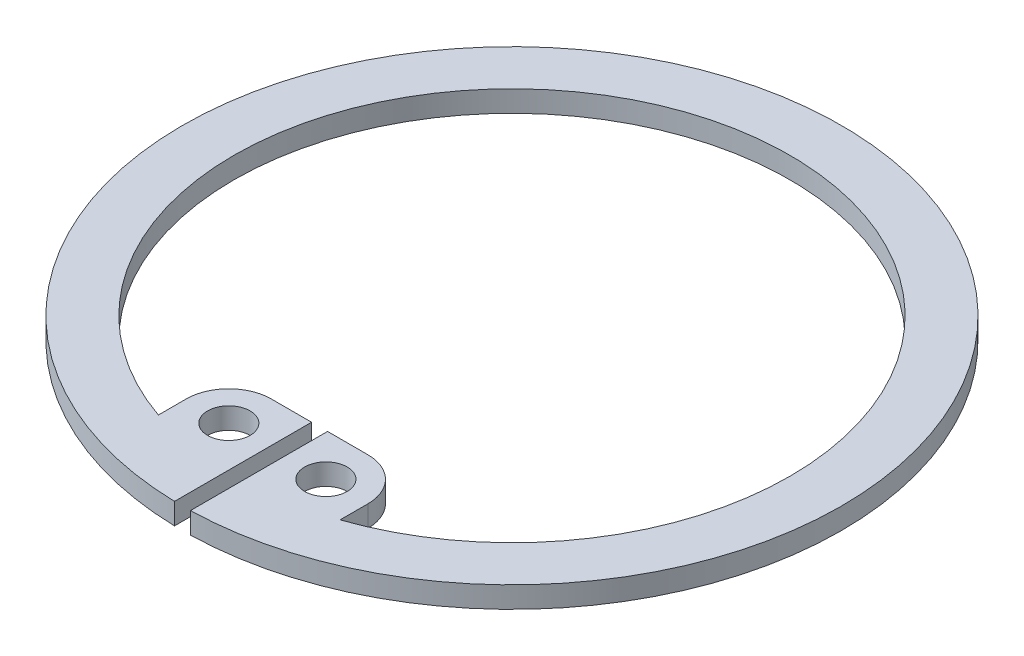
from build123d import *

# Parameters (mm, degrees)
ESQUISSE1_R      = 4
EXTRUSION2_DEPTH = 4
CONG_2_R         = 8


with BuildPart() as part:
    # Esquisse1 → Extrusion2 (new body)
    with BuildSketch(Plane(origin=(0, 0, 0), x_dir=(1, 0, 0), z_dir=(0, 1, 0))):
        with BuildLine():
            Line((-1.5, -61.981852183), (-1.5, -36.193035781))
            Line((-1.5, -36.193035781), (-17.086811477, -36.193035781))
            Line((-17.086811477, -36.193035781), (-17.086811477, -49.430060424))
            ThreePointArc((-17.086811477, -49.430060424), (0, 52.3), (17.086811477, -49.430060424))
            Line((17.086811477, -49.430060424), (17.086811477, -36.193035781))
            Line((17.086811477, -36.193035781), (1.5, -36.193035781))
            Line((1.5, -36.193035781), (1.5, -61.981852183))
            ThreePointArc((1.5, -61.981852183), (0, 62), (-1.5, -61.981852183))
        make_face()
        with Locations(Location((-9.133877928, -44.129091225, 0), (0, 0, 270))):
            Circle(ESQUISSE1_R, mode=Mode.SUBTRACT)
        with Locations(Location((9.133877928, -44.129091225, 0), (0, 0, 90))):
            Circle(ESQUISSE1_R, mode=Mode.SUBTRACT)
    extrude(amount=EXTRUSION2_DEPTH)

    # Cong_2
    cong_2_edges = [part.edges().sort_by_distance(p)[0] for p in [
        (-17.086811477, 2, 36.193035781),
        (17.086811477, 2, 36.193035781),
    ]]
    fillet(cong_2_edges, radius=CONG_2_R)


solid = part.part
